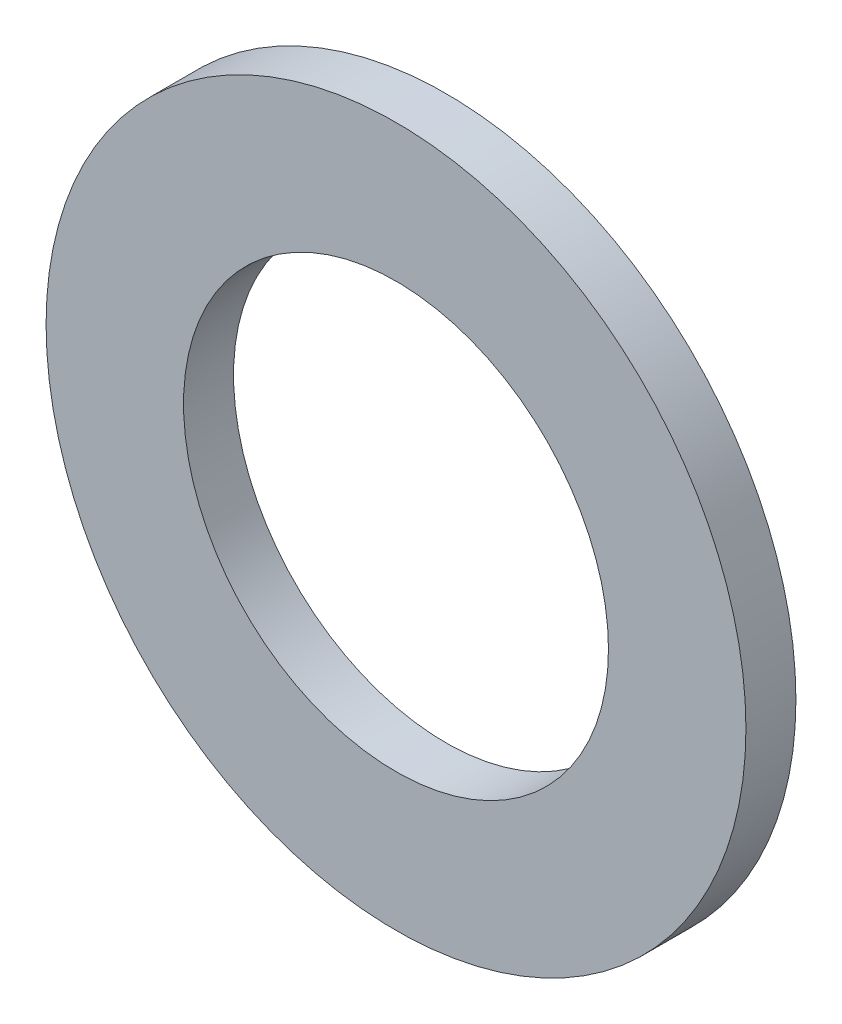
from build123d import *

# Parameters (mm, degrees)
ESQUISSE1_R          = 7
ESQUISSE1_R_2        = 4.25
BASE_EXTRUSION_DEPTH = 1


with BuildPart() as part:
    # Esquisse1 → Base-Extrusion (new body)
    with BuildSketch(Plane.XY):
        Circle(ESQUISSE1_R)
        Circle(ESQUISSE1_R_2, mode=Mode.SUBTRACT)
    extrude(amount=BASE_EXTRUSION_DEPTH)


solid = part.part
